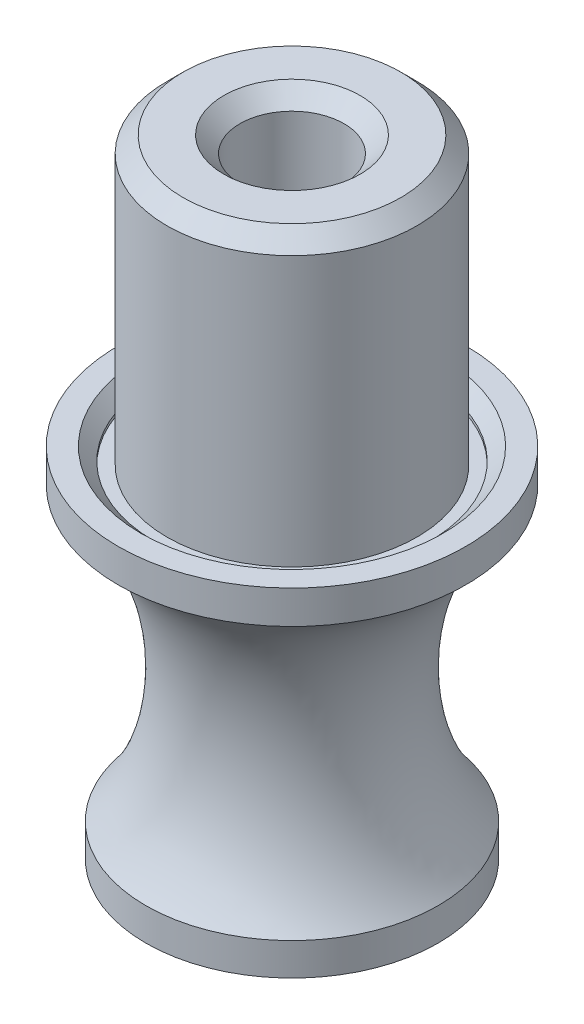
from build123d import *


with BuildPart() as part:
    # Esquisse1 → R_volution1 (revolve)
    with BuildSketch(Plane.XY, mode=Mode.PRIVATE) as r_volution1_sk:
        with BuildLine():
            Line((1.6, 18.8), (1.6, 0.5))
            Line((1.6, 0.5), (2.1, 0))
            Line((2.1, 0), (4.5, 0))
            Line((4.5, 0), (4.5, 1))
            add(Edge.make_bspline(
                [(5.35, 9.974834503), (3.121076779, 8.910855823), (2.251237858, 3.738971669), (4.5, 1)],
                knots=[0, 0, 0, 0, 1, 1, 1, 1], degree=3))
            Line((5.35, 9.974834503), (5.35, 11))
            Line((5.35, 11), (4.65, 11))
            Line((4.65, 11), (4.25, 10.6))
            Line((4.25, 10.6), (4.25, 10.5))
            Line((4.25, 10.5), (3.85, 10.5))
            Line((3.85, 10.5), (3.85, 11))
            Line((3.85, 11), (3.85, 18.8))
            Line((3.85, 18.8), (3.35, 19.3))
            Line((3.35, 19.3), (2.1, 19.3))
            Line((2.1, 19.3), (1.6, 18.8))
        make_face()
    revolve(r_volution1_sk.sketch.rotate(Axis((0, 41.6, 0), (0, -1, 0)), 90), axis=Axis((0, 41.6, 0), (0, -1, 0)))


solid = part.part
